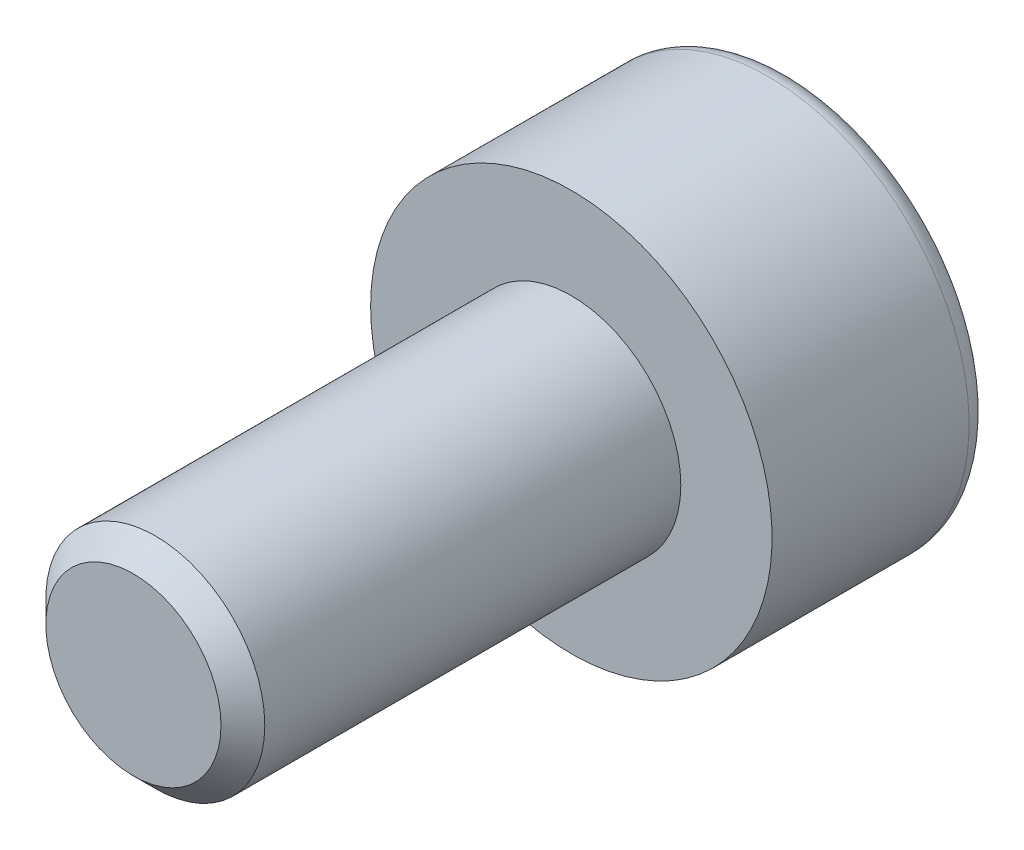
from build123d import *

# Parameters (mm, degrees)
ENLEV_MAT_EXTRU1_DEPTH = 1.3
ESQUISSE3_W            = 1.5
ESQUISSE3_H            = 6
CHANFREIN1_SIZE        = 0.3


with BuildPart() as part:
    # Esquisse1 → Base-R_volution (revolve)
    with BuildSketch(Plane(origin=(0, 0, 0), x_dir=(1, 0, 0), z_dir=(0, 1, 0)), mode=Mode.PRIVATE) as base_r_volution_sk:
        with BuildLine():
            Line((0, 0), (2.75, 0))
            Line((2.75, 0), (2.75, 2.7))
            ThreePointArc((2.75, 2.7), (2.662132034, 2.912132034), (2.45, 3))
            Line((2.45, 3), (0, 3))
            Line((0, 3), (0, 0))
        make_face()
    revolve(base_r_volution_sk.sketch.rotate(Axis((0, 0, 0), (0, 0, -1)), 180), axis=Axis((0, 0, 0), (0, 0, -1)))

    # Esquisse2 → enlev-mat-Extru1 (cut)
    with BuildSketch(Plane.XY.offset(-3)):
        Polygon((1.25, -0.721687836), (1.25, 0.721687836), (0, 1.443375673), (-1.25, 0.721687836), (-1.25, -0.721687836), (0, -1.443375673), align=None)
    extrude(amount=ENLEV_MAT_EXTRU1_DEPTH, mode=Mode.SUBTRACT)

    # Esquisse3 → Boss.-R_vol.1 (revolve)
    with BuildSketch(Plane(origin=(0, 0, 0), x_dir=(1, 0, 0), z_dir=(0, 1, 0))):
        with Locations((0.75, -3)):
            Rectangle(ESQUISSE3_W, ESQUISSE3_H)
    revolve(axis=Axis((0, 0, 0), (0, 0, 1)))

    # Chanfrein1
    chanfrein1_edges = [part.edges().sort_by_distance(p)[0] for p in [
        (-1.5, 0, 6),
    ]]
    chamfer(chanfrein1_edges, length=CHANFREIN1_SIZE)


solid = part.part
